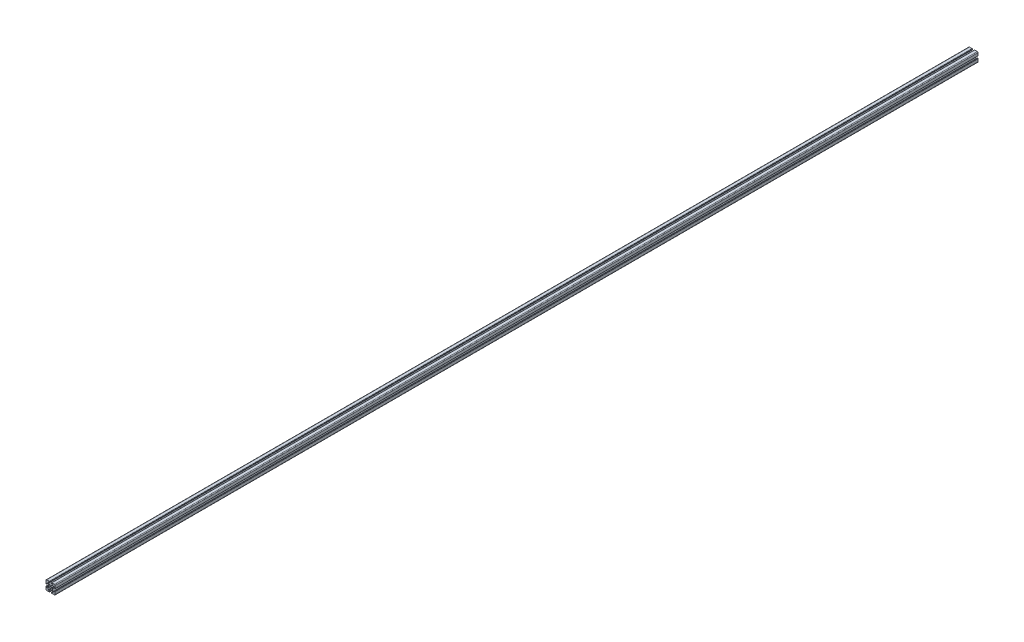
from build123d import *

# Parameters (mm, degrees)
SKETCH1_R      = 3.4
EXTRUDE1_DEPTH = 4000


with BuildPart() as part:
    # Sketch1 → Extrude1 (new body)
    with BuildSketch(Plane.XY):
        with BuildLine():
            Line((-8.715, -15.524615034), (-5.63, -15.524615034))
            ThreePointArc((-5.63, -15.524615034), (-4.519842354, -15.984457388), (-4.06, -17.094615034))
            Line((-4.06, -17.094615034), (-4.06, -18.43))
            ThreePointArc((-4.06, -18.43), (-4.519842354, -19.540157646), (-5.63, -20))
            Line((-5.63, -20), (-16.674615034, -20))
            ThreePointArc((-16.674615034, -20), (-18.951578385, -19.194274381), (-20, -17.018368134))
            Line((-20, -17.018368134), (-20, -5.757918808))
            ThreePointArc((-20, -5.757918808), (-19.564709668, -4.603883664), (-18.43, -4.120449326))
            Line((-18.43, -4.120449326), (-17.25, -4.120449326))
            ThreePointArc((-17.25, -4.120449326), (-16.115287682, -4.60388249), (-15.67999625, -5.757919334))
            Line((-15.67999625, -5.757919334), (-15.67999625, -8.715399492))
            ThreePointArc((-15.67999625, -8.715399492), (-15.220153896, -9.825557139), (-14.10999625, -10.285399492))
            Line((-14.10999625, -10.285399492), (-13.816898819, -10.285399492))
            ThreePointArc((-13.816898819, -10.285399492), (-13.526061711, -10.227547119), (-13.279501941, -10.062800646))
            Line((-13.279501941, -10.062800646), (-9.076242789, -5.859541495))
            ThreePointArc((-9.076242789, -5.859541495), (-8.046572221, -4.318530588), (-7.685, -2.500784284))
            Line((-7.685, -2.500784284), (-7.685, 2.500784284))
            ThreePointArc((-7.685, 2.500784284), (-8.046572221, 4.318530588), (-9.076242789, 5.859541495))
            Line((-9.076242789, 5.859541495), (-13.040489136, 9.823787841))
            ThreePointArc((-13.040489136, 9.823787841), (-13.354224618, 10.012729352), (-13.71989919, 10.033001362))
            Line((-13.71989919, 10.033001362), (-14.05520779, 10.044710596))
            ThreePointArc((-14.05520779, 10.044710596), (-15.200613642, 9.605030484), (-15.68, 8.475666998))
            Line((-15.68, 8.475666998), (-15.68, 5.572979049))
            ThreePointArc((-15.68, 5.572979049), (-16.139842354, 4.462821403), (-17.25, 4.002979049))
            Line((-17.25, 4.002979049), (-18.43, 4.002979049))
            ThreePointArc((-18.43, 4.002979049), (-19.540157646, 4.462821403), (-20, 5.572979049))
            Line((-20, 5.572979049), (-20, 13.004526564))
            Line((-20, 13.004526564), (-20, 16.83))
            ThreePointArc((-20, 16.83), (-19.071528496, 19.071528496), (-16.83, 20))
            Line((-16.83, 20), (-5.63, 20))
            ThreePointArc((-5.63, 20), (-4.519842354, 19.540157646), (-4.06, 18.43))
            Line((-4.06, 18.43), (-4.06, 17.094615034))
            ThreePointArc((-4.06, 17.094615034), (-4.519842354, 15.984457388), (-5.63, 15.524615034))
            Line((-5.63, 15.524615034), (-8.715, 15.524615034))
            ThreePointArc((-8.715, 15.524615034), (-9.825157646, 15.06477268), (-10.285, 13.954615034))
            Line((-10.285, 13.954615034), (-10.285, 13.492503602))
            ThreePointArc((-10.285, 13.492503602), (-10.227148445, 13.201664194), (-10.062401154, 12.955102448))
            Line((-10.062401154, 12.955102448), (-6.217092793, 9.109794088))
            ThreePointArc((-6.217092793, 9.109794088), (-4.63891877, 8.055291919), (-2.777335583, 7.685))
            Line((-2.777335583, 7.685), (2.777335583, 7.685))
            ThreePointArc((2.777335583, 7.685), (4.63891877, 8.055291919), (6.217092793, 9.109794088))
            Line((6.217092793, 9.109794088), (10.062401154, 12.955102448))
            ThreePointArc((10.062401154, 12.955102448), (10.227148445, 13.201664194), (10.285, 13.492503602))
            Line((10.285, 13.492503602), (10.285, 13.954615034))
            ThreePointArc((10.285, 13.954615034), (9.825157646, 15.06477268), (8.715, 15.524615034))
            Line((8.715, 15.524615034), (5.63, 15.524615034))
            ThreePointArc((5.63, 15.524615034), (4.519842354, 15.984457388), (4.06, 17.094615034))
            Line((4.06, 17.094615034), (4.06, 18.43))
            ThreePointArc((4.06, 18.43), (4.519842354, 19.540157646), (5.63, 20))
            Line((5.63, 20), (12.979635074, 20))
            Line((12.979635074, 20), (16.83, 20))
            ThreePointArc((16.83, 20), (19.071528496, 19.071528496), (20, 16.83))
            Line((20, 16.83), (20, 13.001098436))
            Line((20, 13.001098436), (20, 5.63))
            ThreePointArc((20, 5.63), (19.540157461, 4.519842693), (18.43, 4.060000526))
            Line((18.43, 4.060000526), (17.24999625, 4.060000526))
            ThreePointArc((17.24999625, 4.060000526), (16.139838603, 4.519842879), (15.67999625, 5.630000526))
            Line((15.67999625, 5.630000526), (15.67999625, 8.715399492))
            ThreePointArc((15.67999625, 8.715399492), (15.220153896, 9.825557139), (14.10999625, 10.285399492))
            Line((14.10999625, 10.285399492), (13.816903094, 10.285399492))
            ThreePointArc((13.816903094, 10.285399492), (13.526063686, 10.227547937), (13.279501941, 10.062800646))
            Line((13.279501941, 10.062800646), (9.076242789, 5.859541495))
            ThreePointArc((9.076242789, 5.859541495), (8.046572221, 4.318530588), (7.685, 2.500784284))
            Line((7.685, 2.500784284), (7.685, -2.500784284))
            ThreePointArc((7.685, -2.500784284), (8.046572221, -4.318530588), (9.076242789, -5.859541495))
            Line((9.076242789, -5.859541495), (13.163657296, -9.946956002))
            ThreePointArc((13.163657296, -9.946956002), (13.35903797, -10.160433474), (13.6200547, -10.285399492))
            Line((13.6200547, -10.285399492), (14.10999625, -10.285399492))
            ThreePointArc((14.10999625, -10.285399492), (15.220153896, -9.825557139), (15.67999625, -8.715399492))
            Line((15.67999625, -8.715399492), (15.67999625, -5.630000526))
            ThreePointArc((15.67999625, -5.630000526), (16.139838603, -4.519842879), (17.24999625, -4.060000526))
            Line((17.24999625, -4.060000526), (18.43, -4.060000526))
            ThreePointArc((18.43, -4.060000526), (19.540157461, -4.519842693), (20, -5.63))
            Line((20, -5.63), (20, -16.83))
            ThreePointArc((20, -16.83), (19.071528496, -19.071528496), (16.83, -20))
            Line((16.83, -20), (13, -20))
            Line((13, -20), (5.63, -20))
            ThreePointArc((5.63, -20), (4.519842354, -19.540157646), (4.06, -18.43))
            Line((4.06, -18.43), (4.06, -17.094615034))
            ThreePointArc((4.06, -17.094615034), (4.519842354, -15.984457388), (5.63, -15.524615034))
            Line((5.63, -15.524615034), (8.715, -15.524615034))
            ThreePointArc((8.715, -15.524615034), (9.825157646, -15.06477268), (10.285, -13.954615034))
            Line((10.285, -13.954615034), (10.285, -13.492503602))
            ThreePointArc((10.285, -13.492503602), (10.227148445, -13.201664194), (10.062401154, -12.955102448))
            Line((10.062401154, -12.955102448), (6.217092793, -9.109794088))
            ThreePointArc((6.217092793, -9.109794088), (4.63891877, -8.055291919), (2.777335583, -7.685))
            Line((2.777335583, -7.685), (-2.777335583, -7.685))
            ThreePointArc((-2.777335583, -7.685), (-4.63891877, -8.055291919), (-6.217092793, -9.109794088))
            Line((-6.217092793, -9.109794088), (-10.062401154, -12.955102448))
            ThreePointArc((-10.062401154, -12.955102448), (-10.227148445, -13.201664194), (-10.285, -13.492503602))
            Line((-10.285, -13.492503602), (-10.285, -13.954615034))
            ThreePointArc((-10.285, -13.954615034), (-9.825157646, -15.06477268), (-8.715, -15.524615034))
        make_face()
        Circle(SKETCH1_R, mode=Mode.SUBTRACT)
    extrude(amount=-EXTRUDE1_DEPTH)


solid = part.part
